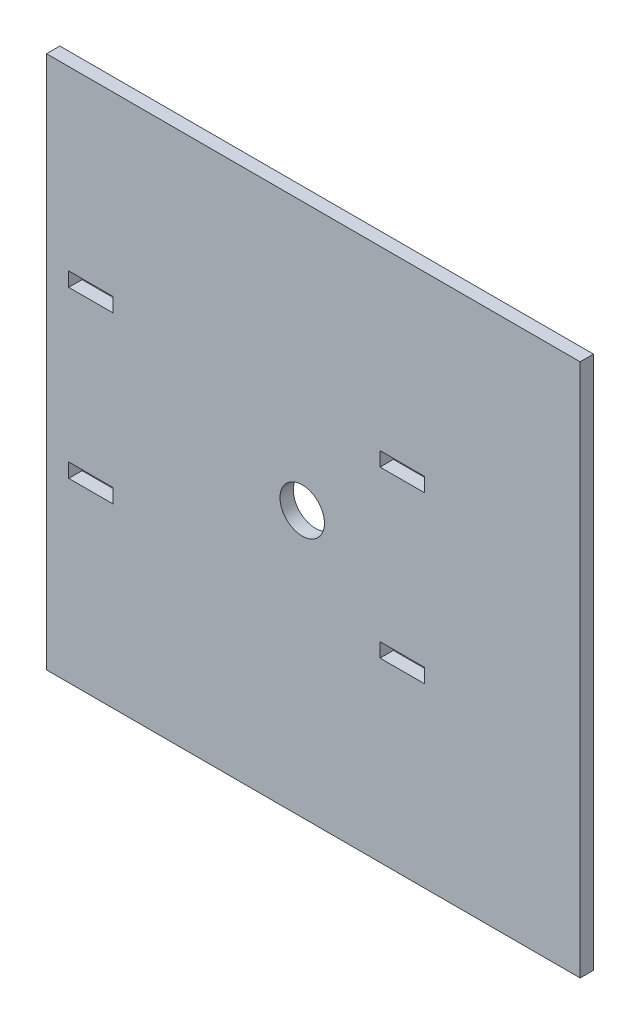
ISO-10303-21;
HEADER;
FILE_DESCRIPTION(('STEP AP214'),'2;1');
FILE_NAME('part.step','',(''),(''),'','','');
FILE_SCHEMA(('AUTOMOTIVE_DESIGN { 1 0 10303 214 1 1 1 1 }'));
ENDSEC;
DATA;
#1=APPLICATION_CONTEXT('core data for automotive mechanical design processes');
#2=APPLICATION_PROTOCOL_DEFINITION('international standard','automotive_design',2000,#1);
#3=PRODUCT_CONTEXT('',#1,'mechanical');
#4=PRODUCT('Part','Part','',(#3));
#5=PRODUCT_RELATED_PRODUCT_CATEGORY('part','',(#4));
#6=PRODUCT_DEFINITION_FORMATION('','',#4);
#7=PRODUCT_DEFINITION_CONTEXT('part definition',#1,'design');
#8=PRODUCT_DEFINITION('design','',#6,#7);
#9=PRODUCT_DEFINITION_SHAPE('','',#8);
#10=(LENGTH_UNIT() NAMED_UNIT(*) SI_UNIT(.MILLI.,.METRE.));
#11=(NAMED_UNIT(*) PLANE_ANGLE_UNIT() SI_UNIT($,.RADIAN.));
#12=(NAMED_UNIT(*) SI_UNIT($,.STERADIAN.) SOLID_ANGLE_UNIT());
#13=UNCERTAINTY_MEASURE_WITH_UNIT(LENGTH_MEASURE(1.E-05),#10,'distance_accuracy_value','');
#14=(GEOMETRIC_REPRESENTATION_CONTEXT(3) GLOBAL_UNCERTAINTY_ASSIGNED_CONTEXT((#13)) GLOBAL_UNIT_ASSIGNED_CONTEXT((#10,
#11,#12)) REPRESENTATION_CONTEXT('',''));
#15=CARTESIAN_POINT('',(0.,0.,0.));
#16=DIRECTION('',(0.,0.,1.));
#17=DIRECTION('',(1.,0.,0.));
#18=AXIS2_PLACEMENT_3D('',#15,#16,#17);
#19=CARTESIAN_POINT('',(0.,0.,3.));
#20=DIRECTION('',(0.,0.,1.));
#21=DIRECTION('',(1.,0.,0.));
#22=AXIS2_PLACEMENT_3D('',#19,#20,#21);
#23=PLANE('',#22);
#24=CARTESIAN_POINT('',(29.0993734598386,-0.2,3.));
#25=DIRECTION('',(0.,0.,1.));
#26=DIRECTION('',(1.,0.,0.));
#27=AXIS2_PLACEMENT_3D('',#24,#25,#26);
#28=CIRCLE('',#27,5.);
#29=CARTESIAN_POINT('',(34.0993734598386,-0.2,3.));
#30=VERTEX_POINT('',#29);
#31=EDGE_CURVE('E198',#30,#30,#28,.T.);
#32=ORIENTED_EDGE('',*,*,#31,.F.);
#33=EDGE_LOOP('',(#32));
#34=FACE_BOUND('',#33,.T.);
#35=DIRECTION('',(0.,-1.,0.));
#36=VECTOR('',#35,1.);
#37=CARTESIAN_POINT('',(-28.4006265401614,60.,3.));
#38=LINE('',#37,#36);
#39=CARTESIAN_POINT('',(-28.4006265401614,60.,3.));
#40=VERTEX_POINT('',#39);
#41=CARTESIAN_POINT('',(-28.4006265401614,-60.,3.));
#42=VERTEX_POINT('',#41);
#43=EDGE_CURVE('E301',#40,#42,#38,.T.);
#44=ORIENTED_EDGE('',*,*,#43,.T.);
#45=DIRECTION('',(1.,0.,0.));
#46=VECTOR('',#45,1.);
#47=CARTESIAN_POINT('',(-28.4006265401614,-60.,3.));
#48=LINE('',#47,#46);
#49=CARTESIAN_POINT('',(91.5993734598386,-60.,3.));
#50=VERTEX_POINT('',#49);
#51=EDGE_CURVE('E304',#42,#50,#48,.T.);
#52=ORIENTED_EDGE('',*,*,#51,.T.);
#53=DIRECTION('',(0.,1.,0.));
#54=VECTOR('',#53,1.);
#55=CARTESIAN_POINT('',(91.5993734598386,60.,3.));
#56=LINE('',#55,#54);
#57=CARTESIAN_POINT('',(91.5993734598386,60.,3.));
#58=VERTEX_POINT('',#57);
#59=EDGE_CURVE('E307',#50,#58,#56,.T.);
#60=ORIENTED_EDGE('',*,*,#59,.T.);
#61=DIRECTION('',(-1.,0.,0.));
#62=VECTOR('',#61,1.);
#63=CARTESIAN_POINT('',(-28.4006265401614,60.,3.));
#64=LINE('',#63,#62);
#65=EDGE_CURVE('E309',#58,#40,#64,.T.);
#66=ORIENTED_EDGE('',*,*,#65,.T.);
#67=EDGE_LOOP('',(#44,#52,#60,#66));
#68=FACE_BOUND('',#67,.T.);
#69=DIRECTION('',(-1.,0.,0.));
#70=VECTOR('',#69,1.);
#71=CARTESIAN_POINT('',(56.5993734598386,20.2,3.));
#72=LINE('',#71,#70);
#73=CARTESIAN_POINT('',(56.5993734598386,20.2,3.));
#74=VERTEX_POINT('',#73);
#75=CARTESIAN_POINT('',(46.5993734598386,20.2,3.));
#76=VERTEX_POINT('',#75);
#77=EDGE_CURVE('E272',#74,#76,#72,.T.);
#78=ORIENTED_EDGE('',*,*,#77,.F.);
#79=DIRECTION('',(0.,1.,0.));
#80=VECTOR('',#79,1.);
#81=CARTESIAN_POINT('',(56.5993734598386,20.2,3.));
#82=LINE('',#81,#80);
#83=CARTESIAN_POINT('',(56.5993734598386,17.,3.));
#84=VERTEX_POINT('',#83);
#85=EDGE_CURVE('E270',#84,#74,#82,.T.);
#86=ORIENTED_EDGE('',*,*,#85,.F.);
#87=DIRECTION('',(1.,0.,0.));
#88=VECTOR('',#87,1.);
#89=CARTESIAN_POINT('',(56.5993734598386,17.,3.));
#90=LINE('',#89,#88);
#91=CARTESIAN_POINT('',(46.5993734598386,17.,3.));
#92=VERTEX_POINT('',#91);
#93=EDGE_CURVE('E278',#92,#84,#90,.T.);
#94=ORIENTED_EDGE('',*,*,#93,.F.);
#95=DIRECTION('',(0.,-1.,0.));
#96=VECTOR('',#95,1.);
#97=CARTESIAN_POINT('',(46.5993734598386,20.2,3.));
#98=LINE('',#97,#96);
#99=EDGE_CURVE('E275',#76,#92,#98,.T.);
#100=ORIENTED_EDGE('',*,*,#99,.F.);
#101=EDGE_LOOP('',(#78,#86,#94,#100));
#102=FACE_BOUND('',#101,.T.);
#103=DIRECTION('',(-1.,0.,0.));
#104=VECTOR('',#103,1.);
#105=CARTESIAN_POINT('',(-13.4006265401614,20.2,3.));
#106=LINE('',#105,#104);
#107=CARTESIAN_POINT('',(-13.4006265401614,20.2,3.));
#108=VERTEX_POINT('',#107);
#109=CARTESIAN_POINT('',(-23.4006265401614,20.2,3.));
#110=VERTEX_POINT('',#109);
#111=EDGE_CURVE('E241',#108,#110,#106,.T.);
#112=ORIENTED_EDGE('',*,*,#111,.F.);
#113=DIRECTION('',(0.,1.,0.));
#114=VECTOR('',#113,1.);
#115=CARTESIAN_POINT('',(-13.4006265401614,20.2,3.));
#116=LINE('',#115,#114);
#117=CARTESIAN_POINT('',(-13.4006265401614,17.,3.));
#118=VERTEX_POINT('',#117);
#119=EDGE_CURVE('E239',#118,#108,#116,.T.);
#120=ORIENTED_EDGE('',*,*,#119,.F.);
#121=DIRECTION('',(1.,0.,0.));
#122=VECTOR('',#121,1.);
#123=CARTESIAN_POINT('',(-13.4006265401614,17.,3.));
#124=LINE('',#123,#122);
#125=CARTESIAN_POINT('',(-23.4006265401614,17.,3.));
#126=VERTEX_POINT('',#125);
#127=EDGE_CURVE('E247',#126,#118,#124,.T.);
#128=ORIENTED_EDGE('',*,*,#127,.F.);
#129=DIRECTION('',(0.,-1.,0.));
#130=VECTOR('',#129,1.);
#131=CARTESIAN_POINT('',(-23.4006265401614,20.2,3.));
#132=LINE('',#131,#130);
#133=EDGE_CURVE('E244',#110,#126,#132,.T.);
#134=ORIENTED_EDGE('',*,*,#133,.F.);
#135=EDGE_LOOP('',(#112,#120,#128,#134));
#136=FACE_BOUND('',#135,.T.);
#137=DIRECTION('',(0.,1.,0.));
#138=VECTOR('',#137,1.);
#139=CARTESIAN_POINT('',(56.5993734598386,-20.2,3.));
#140=LINE('',#139,#138);
#141=CARTESIAN_POINT('',(56.5993734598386,-20.2,3.));
#142=VERTEX_POINT('',#141);
#143=CARTESIAN_POINT('',(56.5993734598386,-17.,3.));
#144=VERTEX_POINT('',#143);
#145=EDGE_CURVE('E210',#142,#144,#140,.T.);
#146=ORIENTED_EDGE('',*,*,#145,.F.);
#147=DIRECTION('',(1.,0.,0.));
#148=VECTOR('',#147,1.);
#149=CARTESIAN_POINT('',(56.5993734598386,-20.2,3.));
#150=LINE('',#149,#148);
#151=CARTESIAN_POINT('',(46.5993734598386,-20.2,3.));
#152=VERTEX_POINT('',#151);
#153=EDGE_CURVE('E208',#152,#142,#150,.T.);
#154=ORIENTED_EDGE('',*,*,#153,.F.);
#155=DIRECTION('',(0.,-1.,0.));
#156=VECTOR('',#155,1.);
#157=CARTESIAN_POINT('',(46.5993734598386,-20.2,3.));
#158=LINE('',#157,#156);
#159=CARTESIAN_POINT('',(46.5993734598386,-17.,3.));
#160=VERTEX_POINT('',#159);
#161=EDGE_CURVE('E216',#160,#152,#158,.T.);
#162=ORIENTED_EDGE('',*,*,#161,.F.);
#163=DIRECTION('',(-1.,0.,0.));
#164=VECTOR('',#163,1.);
#165=CARTESIAN_POINT('',(56.5993734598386,-17.,3.));
#166=LINE('',#165,#164);
#167=EDGE_CURVE('E213',#144,#160,#166,.T.);
#168=ORIENTED_EDGE('',*,*,#167,.F.);
#169=EDGE_LOOP('',(#146,#154,#162,#168));
#170=FACE_BOUND('',#169,.T.);
#171=DIRECTION('',(0.,1.,0.));
#172=VECTOR('',#171,1.);
#173=CARTESIAN_POINT('',(-13.4006265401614,-20.2,3.));
#174=LINE('',#173,#172);
#175=CARTESIAN_POINT('',(-13.4006265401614,-20.2,3.));
#176=VERTEX_POINT('',#175);
#177=CARTESIAN_POINT('',(-13.4006265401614,-17.,3.));
#178=VERTEX_POINT('',#177);
#179=EDGE_CURVE('E178',#176,#178,#174,.T.);
#180=ORIENTED_EDGE('',*,*,#179,.F.);
#181=DIRECTION('',(1.,0.,0.));
#182=VECTOR('',#181,1.);
#183=CARTESIAN_POINT('',(-13.4006265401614,-20.2,3.));
#184=LINE('',#183,#182);
#185=CARTESIAN_POINT('',(-23.4006265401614,-20.2,3.));
#186=VERTEX_POINT('',#185);
#187=EDGE_CURVE('E170',#186,#176,#184,.T.);
#188=ORIENTED_EDGE('',*,*,#187,.F.);
#189=DIRECTION('',(0.,-1.,0.));
#190=VECTOR('',#189,1.);
#191=CARTESIAN_POINT('',(-23.4006265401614,-20.2,3.));
#192=LINE('',#191,#190);
#193=CARTESIAN_POINT('',(-23.4006265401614,-17.,3.));
#194=VERTEX_POINT('',#193);
#195=EDGE_CURVE('E192',#194,#186,#192,.T.);
#196=ORIENTED_EDGE('',*,*,#195,.F.);
#197=DIRECTION('',(-1.,0.,0.));
#198=VECTOR('',#197,1.);
#199=CARTESIAN_POINT('',(-13.4006265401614,-17.,3.));
#200=LINE('',#199,#198);
#201=EDGE_CURVE('E190',#178,#194,#200,.T.);
#202=ORIENTED_EDGE('',*,*,#201,.F.);
#203=EDGE_LOOP('',(#180,#188,#196,#202));
#204=FACE_BOUND('',#203,.T.);
#205=ADVANCED_FACE('F33',(#34,#68,#102,#136,#170,#204),#23,.T.);
#206=CARTESIAN_POINT('',(0.,0.,0.));
#207=DIRECTION('',(0.,0.,1.));
#208=DIRECTION('',(1.,0.,0.));
#209=AXIS2_PLACEMENT_3D('',#206,#207,#208);
#210=PLANE('',#209);
#211=CARTESIAN_POINT('',(29.0993734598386,-0.2,0.));
#212=DIRECTION('',(0.,0.,-1.));
#213=DIRECTION('',(-1.,0.,0.));
#214=AXIS2_PLACEMENT_3D('',#211,#212,#213);
#215=CIRCLE('',#214,5.);
#216=CARTESIAN_POINT('',(24.0993734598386,-0.2,0.));
#217=VERTEX_POINT('',#216);
#218=EDGE_CURVE('E546',#217,#217,#215,.T.);
#219=ORIENTED_EDGE('',*,*,#218,.F.);
#220=EDGE_LOOP('',(#219));
#221=FACE_BOUND('',#220,.T.);
#222=DIRECTION('',(1.,0.,0.));
#223=VECTOR('',#222,1.);
#224=CARTESIAN_POINT('',(56.5993734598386,-20.2,0.));
#225=LINE('',#224,#223);
#226=CARTESIAN_POINT('',(46.5993734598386,-20.2,0.));
#227=VERTEX_POINT('',#226);
#228=CARTESIAN_POINT('',(56.5993734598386,-20.2,0.));
#229=VERTEX_POINT('',#228);
#230=EDGE_CURVE('E186',#227,#229,#225,.T.);
#231=ORIENTED_EDGE('',*,*,#230,.T.);
#232=DIRECTION('',(0.,1.,0.));
#233=VECTOR('',#232,1.);
#234=CARTESIAN_POINT('',(56.5993734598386,-20.2,0.));
#235=LINE('',#234,#233);
#236=CARTESIAN_POINT('',(56.5993734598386,-17.,0.));
#237=VERTEX_POINT('',#236);
#238=EDGE_CURVE('E221',#229,#237,#235,.T.);
#239=ORIENTED_EDGE('',*,*,#238,.T.);
#240=DIRECTION('',(-1.,0.,0.));
#241=VECTOR('',#240,1.);
#242=CARTESIAN_POINT('',(56.5993734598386,-17.,0.));
#243=LINE('',#242,#241);
#244=CARTESIAN_POINT('',(46.5993734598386,-17.,0.));
#245=VERTEX_POINT('',#244);
#246=EDGE_CURVE('E224',#237,#245,#243,.T.);
#247=ORIENTED_EDGE('',*,*,#246,.T.);
#248=DIRECTION('',(0.,-1.,0.));
#249=VECTOR('',#248,1.);
#250=CARTESIAN_POINT('',(46.5993734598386,-20.2,0.));
#251=LINE('',#250,#249);
#252=EDGE_CURVE('E211',#245,#227,#251,.T.);
#253=ORIENTED_EDGE('',*,*,#252,.T.);
#254=EDGE_LOOP('',(#231,#239,#247,#253));
#255=FACE_BOUND('',#254,.T.);
#256=DIRECTION('',(0.,1.,0.));
#257=VECTOR('',#256,1.);
#258=CARTESIAN_POINT('',(56.5993734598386,20.2,0.));
#259=LINE('',#258,#257);
#260=CARTESIAN_POINT('',(56.5993734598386,17.,0.));
#261=VERTEX_POINT('',#260);
#262=CARTESIAN_POINT('',(56.5993734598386,20.2,0.));
#263=VERTEX_POINT('',#262);
#264=EDGE_CURVE('E269',#261,#263,#259,.T.);
#265=ORIENTED_EDGE('',*,*,#264,.T.);
#266=DIRECTION('',(-1.,0.,0.));
#267=VECTOR('',#266,1.);
#268=CARTESIAN_POINT('',(56.5993734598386,20.2,0.));
#269=LINE('',#268,#267);
#270=CARTESIAN_POINT('',(46.5993734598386,20.2,0.));
#271=VERTEX_POINT('',#270);
#272=EDGE_CURVE('E283',#263,#271,#269,.T.);
#273=ORIENTED_EDGE('',*,*,#272,.T.);
#274=DIRECTION('',(0.,-1.,0.));
#275=VECTOR('',#274,1.);
#276=CARTESIAN_POINT('',(46.5993734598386,20.2,0.));
#277=LINE('',#276,#275);
#278=CARTESIAN_POINT('',(46.5993734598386,17.,0.));
#279=VERTEX_POINT('',#278);
#280=EDGE_CURVE('E286',#271,#279,#277,.T.);
#281=ORIENTED_EDGE('',*,*,#280,.T.);
#282=DIRECTION('',(1.,0.,0.));
#283=VECTOR('',#282,1.);
#284=CARTESIAN_POINT('',(56.5993734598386,17.,0.));
#285=LINE('',#284,#283);
#286=EDGE_CURVE('E273',#279,#261,#285,.T.);
#287=ORIENTED_EDGE('',*,*,#286,.T.);
#288=EDGE_LOOP('',(#265,#273,#281,#287));
#289=FACE_BOUND('',#288,.T.);
#290=DIRECTION('',(0.,-1.,0.));
#291=VECTOR('',#290,1.);
#292=CARTESIAN_POINT('',(-28.4006265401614,60.,0.));
#293=LINE('',#292,#291);
#294=CARTESIAN_POINT('',(-28.4006265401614,60.,0.));
#295=VERTEX_POINT('',#294);
#296=CARTESIAN_POINT('',(-28.4006265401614,-60.,0.));
#297=VERTEX_POINT('',#296);
#298=EDGE_CURVE('E300',#295,#297,#293,.T.);
#299=ORIENTED_EDGE('',*,*,#298,.F.);
#300=DIRECTION('',(-1.,0.,0.));
#301=VECTOR('',#300,1.);
#302=CARTESIAN_POINT('',(-28.4006265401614,60.,0.));
#303=LINE('',#302,#301);
#304=CARTESIAN_POINT('',(91.5993734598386,60.,0.));
#305=VERTEX_POINT('',#304);
#306=EDGE_CURVE('E305',#305,#295,#303,.T.);
#307=ORIENTED_EDGE('',*,*,#306,.F.);
#308=DIRECTION('',(0.,1.,0.));
#309=VECTOR('',#308,1.);
#310=CARTESIAN_POINT('',(91.5993734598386,60.,0.));
#311=LINE('',#310,#309);
#312=CARTESIAN_POINT('',(91.5993734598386,-60.,0.));
#313=VERTEX_POINT('',#312);
#314=EDGE_CURVE('E316',#313,#305,#311,.T.);
#315=ORIENTED_EDGE('',*,*,#314,.F.);
#316=DIRECTION('',(1.,0.,0.));
#317=VECTOR('',#316,1.);
#318=CARTESIAN_POINT('',(-28.4006265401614,-60.,0.));
#319=LINE('',#318,#317);
#320=EDGE_CURVE('E314',#297,#313,#319,.T.);
#321=ORIENTED_EDGE('',*,*,#320,.F.);
#322=EDGE_LOOP('',(#299,#307,#315,#321));
#323=FACE_BOUND('',#322,.T.);
#324=DIRECTION('',(0.,1.,0.));
#325=VECTOR('',#324,1.);
#326=CARTESIAN_POINT('',(-13.4006265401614,20.2,0.));
#327=LINE('',#326,#325);
#328=CARTESIAN_POINT('',(-13.4006265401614,17.,0.));
#329=VERTEX_POINT('',#328);
#330=CARTESIAN_POINT('',(-13.4006265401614,20.2,0.));
#331=VERTEX_POINT('',#330);
#332=EDGE_CURVE('E238',#329,#331,#327,.T.);
#333=ORIENTED_EDGE('',*,*,#332,.T.);
#334=DIRECTION('',(-1.,0.,0.));
#335=VECTOR('',#334,1.);
#336=CARTESIAN_POINT('',(-13.4006265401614,20.2,0.));
#337=LINE('',#336,#335);
#338=CARTESIAN_POINT('',(-23.4006265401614,20.2,0.));
#339=VERTEX_POINT('',#338);
#340=EDGE_CURVE('E252',#331,#339,#337,.T.);
#341=ORIENTED_EDGE('',*,*,#340,.T.);
#342=DIRECTION('',(0.,-1.,0.));
#343=VECTOR('',#342,1.);
#344=CARTESIAN_POINT('',(-23.4006265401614,20.2,0.));
#345=LINE('',#344,#343);
#346=CARTESIAN_POINT('',(-23.4006265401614,17.,0.));
#347=VERTEX_POINT('',#346);
#348=EDGE_CURVE('E255',#339,#347,#345,.T.);
#349=ORIENTED_EDGE('',*,*,#348,.T.);
#350=DIRECTION('',(1.,0.,0.));
#351=VECTOR('',#350,1.);
#352=CARTESIAN_POINT('',(-13.4006265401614,17.,0.));
#353=LINE('',#352,#351);
#354=EDGE_CURVE('E242',#347,#329,#353,.T.);
#355=ORIENTED_EDGE('',*,*,#354,.T.);
#356=EDGE_LOOP('',(#333,#341,#349,#355));
#357=FACE_BOUND('',#356,.T.);
#358=DIRECTION('',(1.,0.,0.));
#359=VECTOR('',#358,1.);
#360=CARTESIAN_POINT('',(-13.4006265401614,-20.2,0.));
#361=LINE('',#360,#359);
#362=CARTESIAN_POINT('',(-23.4006265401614,-20.2,0.));
#363=VERTEX_POINT('',#362);
#364=CARTESIAN_POINT('',(-13.4006265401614,-20.2,0.));
#365=VERTEX_POINT('',#364);
#366=EDGE_CURVE('E56',#363,#365,#361,.T.);
#367=ORIENTED_EDGE('',*,*,#366,.T.);
#368=DIRECTION('',(0.,1.,0.));
#369=VECTOR('',#368,1.);
#370=CARTESIAN_POINT('',(-13.4006265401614,-20.2,0.));
#371=LINE('',#370,#369);
#372=CARTESIAN_POINT('',(-13.4006265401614,-17.,0.));
#373=VERTEX_POINT('',#372);
#374=EDGE_CURVE('E185',#365,#373,#371,.T.);
#375=ORIENTED_EDGE('',*,*,#374,.T.);
#376=DIRECTION('',(-1.,0.,0.));
#377=VECTOR('',#376,1.);
#378=CARTESIAN_POINT('',(-13.4006265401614,-17.,0.));
#379=LINE('',#378,#377);
#380=CARTESIAN_POINT('',(-23.4006265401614,-17.,0.));
#381=VERTEX_POINT('',#380);
#382=EDGE_CURVE('E200',#373,#381,#379,.T.);
#383=ORIENTED_EDGE('',*,*,#382,.T.);
#384=DIRECTION('',(0.,-1.,0.));
#385=VECTOR('',#384,1.);
#386=CARTESIAN_POINT('',(-23.4006265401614,-20.2,0.));
#387=LINE('',#386,#385);
#388=EDGE_CURVE('E179',#381,#363,#387,.T.);
#389=ORIENTED_EDGE('',*,*,#388,.T.);
#390=EDGE_LOOP('',(#367,#375,#383,#389));
#391=FACE_BOUND('',#390,.T.);
#392=ADVANCED_FACE('F334',(#221,#255,#289,#323,#357,#391),#210,.F.);
#393=CARTESIAN_POINT('',(-28.4006265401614,60.,3.));
#394=DIRECTION('',(1.,0.,0.));
#395=DIRECTION('',(0.,1.,0.));
#396=AXIS2_PLACEMENT_3D('',#393,#394,#395);
#397=PLANE('',#396);
#398=ORIENTED_EDGE('',*,*,#298,.T.);
#399=DIRECTION('',(0.,0.,-1.));
#400=VECTOR('',#399,1.);
#401=CARTESIAN_POINT('',(-28.4006265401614,-60.,3.));
#402=LINE('',#401,#400);
#403=EDGE_CURVE('E11',#42,#297,#402,.T.);
#404=ORIENTED_EDGE('',*,*,#403,.F.);
#405=ORIENTED_EDGE('',*,*,#43,.F.);
#406=DIRECTION('',(0.,0.,-1.));
#407=VECTOR('',#406,1.);
#408=CARTESIAN_POINT('',(-28.4006265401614,60.,3.));
#409=LINE('',#408,#407);
#410=EDGE_CURVE('E311',#40,#295,#409,.T.);
#411=ORIENTED_EDGE('',*,*,#410,.T.);
#412=EDGE_LOOP('',(#398,#404,#405,#411));
#413=FACE_BOUND('',#412,.T.);
#414=ADVANCED_FACE('F35',(#413),#397,.F.);
#415=CARTESIAN_POINT('',(-28.4006265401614,-60.,3.));
#416=DIRECTION('',(0.,1.,0.));
#417=DIRECTION('',(0.,0.,1.));
#418=AXIS2_PLACEMENT_3D('',#415,#416,#417);
#419=PLANE('',#418);
#420=ORIENTED_EDGE('',*,*,#320,.T.);
#421=DIRECTION('',(0.,0.,-1.));
#422=VECTOR('',#421,1.);
#423=CARTESIAN_POINT('',(91.5993734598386,-60.,3.));
#424=LINE('',#423,#422);
#425=EDGE_CURVE('E41',#50,#313,#424,.T.);
#426=ORIENTED_EDGE('',*,*,#425,.F.);
#427=ORIENTED_EDGE('',*,*,#51,.F.);
#428=ORIENTED_EDGE('',*,*,#403,.T.);
#429=EDGE_LOOP('',(#420,#426,#427,#428));
#430=FACE_BOUND('',#429,.T.);
#431=ADVANCED_FACE('F345',(#430),#419,.F.);
#432=CARTESIAN_POINT('',(91.5993734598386,60.,3.));
#433=DIRECTION('',(-1.,0.,0.));
#434=DIRECTION('',(0.,-1.,0.));
#435=AXIS2_PLACEMENT_3D('',#432,#433,#434);
#436=PLANE('',#435);
#437=ORIENTED_EDGE('',*,*,#314,.T.);
#438=DIRECTION('',(0.,0.,-1.));
#439=VECTOR('',#438,1.);
#440=CARTESIAN_POINT('',(91.5993734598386,60.,3.));
#441=LINE('',#440,#439);
#442=EDGE_CURVE('E321',#58,#305,#441,.T.);
#443=ORIENTED_EDGE('',*,*,#442,.F.);
#444=ORIENTED_EDGE('',*,*,#59,.F.);
#445=ORIENTED_EDGE('',*,*,#425,.T.);
#446=EDGE_LOOP('',(#437,#443,#444,#445));
#447=FACE_BOUND('',#446,.T.);
#448=ADVANCED_FACE('F328',(#447),#436,.F.);
#449=CARTESIAN_POINT('',(-28.4006265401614,60.,3.));
#450=DIRECTION('',(0.,-1.,0.));
#451=DIRECTION('',(0.,0.,-1.));
#452=AXIS2_PLACEMENT_3D('',#449,#450,#451);
#453=PLANE('',#452);
#454=ORIENTED_EDGE('',*,*,#306,.T.);
#455=ORIENTED_EDGE('',*,*,#410,.F.);
#456=ORIENTED_EDGE('',*,*,#65,.F.);
#457=ORIENTED_EDGE('',*,*,#442,.T.);
#458=EDGE_LOOP('',(#454,#455,#456,#457));
#459=FACE_BOUND('',#458,.T.);
#460=ADVANCED_FACE('F338',(#459),#453,.F.);
#461=CARTESIAN_POINT('',(56.5993734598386,20.2,3.));
#462=DIRECTION('',(-1.,0.,0.));
#463=DIRECTION('',(0.,-1.,0.));
#464=AXIS2_PLACEMENT_3D('',#461,#462,#463);
#465=PLANE('',#464);
#466=ORIENTED_EDGE('',*,*,#264,.F.);
#467=DIRECTION('',(0.,0.,-1.));
#468=VECTOR('',#467,1.);
#469=CARTESIAN_POINT('',(56.5993734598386,17.,3.));
#470=LINE('',#469,#468);
#471=EDGE_CURVE('E280',#84,#261,#470,.T.);
#472=ORIENTED_EDGE('',*,*,#471,.F.);
#473=ORIENTED_EDGE('',*,*,#85,.T.);
#474=DIRECTION('',(0.,0.,-1.));
#475=VECTOR('',#474,1.);
#476=CARTESIAN_POINT('',(56.5993734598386,20.2,3.));
#477=LINE('',#476,#475);
#478=EDGE_CURVE('E297',#74,#263,#477,.T.);
#479=ORIENTED_EDGE('',*,*,#478,.T.);
#480=EDGE_LOOP('',(#466,#472,#473,#479));
#481=FACE_BOUND('',#480,.T.);
#482=ADVANCED_FACE('F362',(#481),#465,.T.);
#483=CARTESIAN_POINT('',(56.5993734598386,20.2,3.));
#484=DIRECTION('',(0.,-1.,0.));
#485=DIRECTION('',(0.,0.,-1.));
#486=AXIS2_PLACEMENT_3D('',#483,#484,#485);
#487=PLANE('',#486);
#488=ORIENTED_EDGE('',*,*,#272,.F.);
#489=ORIENTED_EDGE('',*,*,#478,.F.);
#490=ORIENTED_EDGE('',*,*,#77,.T.);
#491=DIRECTION('',(0.,0.,-1.));
#492=VECTOR('',#491,1.);
#493=CARTESIAN_POINT('',(46.5993734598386,20.2,3.));
#494=LINE('',#493,#492);
#495=EDGE_CURVE('E295',#76,#271,#494,.T.);
#496=ORIENTED_EDGE('',*,*,#495,.T.);
#497=EDGE_LOOP('',(#488,#489,#490,#496));
#498=FACE_BOUND('',#497,.T.);
#499=ADVANCED_FACE('F369',(#498),#487,.T.);
#500=CARTESIAN_POINT('',(46.5993734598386,20.2,3.));
#501=DIRECTION('',(1.,0.,0.));
#502=DIRECTION('',(0.,0.,-1.));
#503=AXIS2_PLACEMENT_3D('',#500,#501,#502);
#504=PLANE('',#503);
#505=ORIENTED_EDGE('',*,*,#280,.F.);
#506=ORIENTED_EDGE('',*,*,#495,.F.);
#507=ORIENTED_EDGE('',*,*,#99,.T.);
#508=DIRECTION('',(0.,0.,-1.));
#509=VECTOR('',#508,1.);
#510=CARTESIAN_POINT('',(46.5993734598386,17.,3.));
#511=LINE('',#510,#509);
#512=EDGE_CURVE('E293',#92,#279,#511,.T.);
#513=ORIENTED_EDGE('',*,*,#512,.T.);
#514=EDGE_LOOP('',(#505,#506,#507,#513));
#515=FACE_BOUND('',#514,.T.);
#516=ADVANCED_FACE('F374',(#515),#504,.T.);
#517=CARTESIAN_POINT('',(56.5993734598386,17.,3.));
#518=DIRECTION('',(0.,1.,0.));
#519=DIRECTION('',(0.,0.,1.));
#520=AXIS2_PLACEMENT_3D('',#517,#518,#519);
#521=PLANE('',#520);
#522=ORIENTED_EDGE('',*,*,#286,.F.);
#523=ORIENTED_EDGE('',*,*,#512,.F.);
#524=ORIENTED_EDGE('',*,*,#93,.T.);
#525=ORIENTED_EDGE('',*,*,#471,.T.);
#526=EDGE_LOOP('',(#522,#523,#524,#525));
#527=FACE_BOUND('',#526,.T.);
#528=ADVANCED_FACE('F382',(#527),#521,.T.);
#529=CARTESIAN_POINT('',(-13.4006265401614,20.2,3.));
#530=DIRECTION('',(-1.,0.,0.));
#531=DIRECTION('',(0.,0.,1.));
#532=AXIS2_PLACEMENT_3D('',#529,#530,#531);
#533=PLANE('',#532);
#534=ORIENTED_EDGE('',*,*,#332,.F.);
#535=DIRECTION('',(0.,0.,-1.));
#536=VECTOR('',#535,1.);
#537=CARTESIAN_POINT('',(-13.4006265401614,17.,3.));
#538=LINE('',#537,#536);
#539=EDGE_CURVE('E249',#118,#329,#538,.T.);
#540=ORIENTED_EDGE('',*,*,#539,.F.);
#541=ORIENTED_EDGE('',*,*,#119,.T.);
#542=DIRECTION('',(0.,0.,-1.));
#543=VECTOR('',#542,1.);
#544=CARTESIAN_POINT('',(-13.4006265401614,20.2,3.));
#545=LINE('',#544,#543);
#546=EDGE_CURVE('E266',#108,#331,#545,.T.);
#547=ORIENTED_EDGE('',*,*,#546,.T.);
#548=EDGE_LOOP('',(#534,#540,#541,#547));
#549=FACE_BOUND('',#548,.T.);
#550=ADVANCED_FACE('F437',(#549),#533,.T.);
#551=CARTESIAN_POINT('',(-13.4006265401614,20.2,3.));
#552=DIRECTION('',(0.,-1.,0.));
#553=DIRECTION('',(0.,0.,-1.));
#554=AXIS2_PLACEMENT_3D('',#551,#552,#553);
#555=PLANE('',#554);
#556=ORIENTED_EDGE('',*,*,#340,.F.);
#557=ORIENTED_EDGE('',*,*,#546,.F.);
#558=ORIENTED_EDGE('',*,*,#111,.T.);
#559=DIRECTION('',(0.,0.,-1.));
#560=VECTOR('',#559,1.);
#561=CARTESIAN_POINT('',(-23.4006265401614,20.2,3.));
#562=LINE('',#561,#560);
#563=EDGE_CURVE('E264',#110,#339,#562,.T.);
#564=ORIENTED_EDGE('',*,*,#563,.T.);
#565=EDGE_LOOP('',(#556,#557,#558,#564));
#566=FACE_BOUND('',#565,.T.);
#567=ADVANCED_FACE('F433',(#566),#555,.T.);
#568=CARTESIAN_POINT('',(-23.4006265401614,20.2,3.));
#569=DIRECTION('',(1.,0.,0.));
#570=DIRECTION('',(0.,0.,-1.));
#571=AXIS2_PLACEMENT_3D('',#568,#569,#570);
#572=PLANE('',#571);
#573=ORIENTED_EDGE('',*,*,#348,.F.);
#574=ORIENTED_EDGE('',*,*,#563,.F.);
#575=ORIENTED_EDGE('',*,*,#133,.T.);
#576=DIRECTION('',(0.,0.,-1.));
#577=VECTOR('',#576,1.);
#578=CARTESIAN_POINT('',(-23.4006265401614,17.,3.));
#579=LINE('',#578,#577);
#580=EDGE_CURVE('E262',#126,#347,#579,.T.);
#581=ORIENTED_EDGE('',*,*,#580,.T.);
#582=EDGE_LOOP('',(#573,#574,#575,#581));
#583=FACE_BOUND('',#582,.T.);
#584=ADVANCED_FACE('F429',(#583),#572,.T.);
#585=CARTESIAN_POINT('',(-13.4006265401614,17.,3.));
#586=DIRECTION('',(0.,1.,0.));
#587=DIRECTION('',(-1.,0.,0.));
#588=AXIS2_PLACEMENT_3D('',#585,#586,#587);
#589=PLANE('',#588);
#590=ORIENTED_EDGE('',*,*,#354,.F.);
#591=ORIENTED_EDGE('',*,*,#580,.F.);
#592=ORIENTED_EDGE('',*,*,#127,.T.);
#593=ORIENTED_EDGE('',*,*,#539,.T.);
#594=EDGE_LOOP('',(#590,#591,#592,#593));
#595=FACE_BOUND('',#594,.T.);
#596=ADVANCED_FACE('F426',(#595),#589,.T.);
#597=CARTESIAN_POINT('',(56.5993734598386,-20.2,3.));
#598=DIRECTION('',(0.,1.,0.));
#599=DIRECTION('',(0.,0.,1.));
#600=AXIS2_PLACEMENT_3D('',#597,#598,#599);
#601=PLANE('',#600);
#602=ORIENTED_EDGE('',*,*,#230,.F.);
#603=DIRECTION('',(0.,0.,-1.));
#604=VECTOR('',#603,1.);
#605=CARTESIAN_POINT('',(46.5993734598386,-20.2,3.));
#606=LINE('',#605,#604);
#607=EDGE_CURVE('E218',#152,#227,#606,.T.);
#608=ORIENTED_EDGE('',*,*,#607,.F.);
#609=ORIENTED_EDGE('',*,*,#153,.T.);
#610=DIRECTION('',(0.,0.,-1.));
#611=VECTOR('',#610,1.);
#612=CARTESIAN_POINT('',(56.5993734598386,-20.2,3.));
#613=LINE('',#612,#611);
#614=EDGE_CURVE('E235',#142,#229,#613,.T.);
#615=ORIENTED_EDGE('',*,*,#614,.T.);
#616=EDGE_LOOP('',(#602,#608,#609,#615));
#617=FACE_BOUND('',#616,.T.);
#618=ADVANCED_FACE('F408',(#617),#601,.T.);
#619=CARTESIAN_POINT('',(56.5993734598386,-20.2,3.));
#620=DIRECTION('',(-1.,0.,0.));
#621=DIRECTION('',(0.,-1.,0.));
#622=AXIS2_PLACEMENT_3D('',#619,#620,#621);
#623=PLANE('',#622);
#624=ORIENTED_EDGE('',*,*,#238,.F.);
#625=ORIENTED_EDGE('',*,*,#614,.F.);
#626=ORIENTED_EDGE('',*,*,#145,.T.);
#627=DIRECTION('',(0.,0.,-1.));
#628=VECTOR('',#627,1.);
#629=CARTESIAN_POINT('',(56.5993734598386,-17.,3.));
#630=LINE('',#629,#628);
#631=EDGE_CURVE('E233',#144,#237,#630,.T.);
#632=ORIENTED_EDGE('',*,*,#631,.T.);
#633=EDGE_LOOP('',(#624,#625,#626,#632));
#634=FACE_BOUND('',#633,.T.);
#635=ADVANCED_FACE('F401',(#634),#623,.T.);
#636=CARTESIAN_POINT('',(56.5993734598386,-17.,3.));
#637=DIRECTION('',(0.,-1.,0.));
#638=DIRECTION('',(0.,0.,-1.));
#639=AXIS2_PLACEMENT_3D('',#636,#637,#638);
#640=PLANE('',#639);
#641=ORIENTED_EDGE('',*,*,#246,.F.);
#642=ORIENTED_EDGE('',*,*,#631,.F.);
#643=ORIENTED_EDGE('',*,*,#167,.T.);
#644=DIRECTION('',(0.,0.,-1.));
#645=VECTOR('',#644,1.);
#646=CARTESIAN_POINT('',(46.5993734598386,-17.,3.));
#647=LINE('',#646,#645);
#648=EDGE_CURVE('E231',#160,#245,#647,.T.);
#649=ORIENTED_EDGE('',*,*,#648,.T.);
#650=EDGE_LOOP('',(#641,#642,#643,#649));
#651=FACE_BOUND('',#650,.T.);
#652=ADVANCED_FACE('F404',(#651),#640,.T.);
#653=CARTESIAN_POINT('',(46.5993734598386,-20.2,3.));
#654=DIRECTION('',(1.,0.,0.));
#655=DIRECTION('',(0.,0.,-1.));
#656=AXIS2_PLACEMENT_3D('',#653,#654,#655);
#657=PLANE('',#656);
#658=ORIENTED_EDGE('',*,*,#252,.F.);
#659=ORIENTED_EDGE('',*,*,#648,.F.);
#660=ORIENTED_EDGE('',*,*,#161,.T.);
#661=ORIENTED_EDGE('',*,*,#607,.T.);
#662=EDGE_LOOP('',(#658,#659,#660,#661));
#663=FACE_BOUND('',#662,.T.);
#664=ADVANCED_FACE('F411',(#663),#657,.T.);
#665=CARTESIAN_POINT('',(-13.4006265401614,-20.2,3.));
#666=DIRECTION('',(0.,1.,0.));
#667=DIRECTION('',(0.,0.,1.));
#668=AXIS2_PLACEMENT_3D('',#665,#666,#667);
#669=PLANE('',#668);
#670=ORIENTED_EDGE('',*,*,#366,.F.);
#671=DIRECTION('',(0.,0.,-1.));
#672=VECTOR('',#671,1.);
#673=CARTESIAN_POINT('',(-23.4006265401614,-20.2,3.));
#674=LINE('',#673,#672);
#675=EDGE_CURVE('E174',#186,#363,#674,.T.);
#676=ORIENTED_EDGE('',*,*,#675,.F.);
#677=ORIENTED_EDGE('',*,*,#187,.T.);
#678=DIRECTION('',(0.,0.,-1.));
#679=VECTOR('',#678,1.);
#680=CARTESIAN_POINT('',(-13.4006265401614,-20.2,3.));
#681=LINE('',#680,#679);
#682=EDGE_CURVE('E173',#176,#365,#681,.T.);
#683=ORIENTED_EDGE('',*,*,#682,.T.);
#684=EDGE_LOOP('',(#670,#676,#677,#683));
#685=FACE_BOUND('',#684,.T.);
#686=ADVANCED_FACE('F172',(#685),#669,.T.);
#687=CARTESIAN_POINT('',(-13.4006265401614,-20.2,3.));
#688=DIRECTION('',(-1.,0.,0.));
#689=DIRECTION('',(0.,0.,1.));
#690=AXIS2_PLACEMENT_3D('',#687,#688,#689);
#691=PLANE('',#690);
#692=ORIENTED_EDGE('',*,*,#374,.F.);
#693=ORIENTED_EDGE('',*,*,#682,.F.);
#694=ORIENTED_EDGE('',*,*,#179,.T.);
#695=DIRECTION('',(0.,0.,-1.));
#696=VECTOR('',#695,1.);
#697=CARTESIAN_POINT('',(-13.4006265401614,-17.,3.));
#698=LINE('',#697,#696);
#699=EDGE_CURVE('E187',#178,#373,#698,.T.);
#700=ORIENTED_EDGE('',*,*,#699,.T.);
#701=EDGE_LOOP('',(#692,#693,#694,#700));
#702=FACE_BOUND('',#701,.T.);
#703=ADVANCED_FACE('F182',(#702),#691,.T.);
#704=CARTESIAN_POINT('',(-13.4006265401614,-17.,3.));
#705=DIRECTION('',(0.,-1.,0.));
#706=DIRECTION('',(1.,0.,0.));
#707=AXIS2_PLACEMENT_3D('',#704,#705,#706);
#708=PLANE('',#707);
#709=ORIENTED_EDGE('',*,*,#382,.F.);
#710=ORIENTED_EDGE('',*,*,#699,.F.);
#711=ORIENTED_EDGE('',*,*,#201,.T.);
#712=DIRECTION('',(0.,0.,-1.));
#713=VECTOR('',#712,1.);
#714=CARTESIAN_POINT('',(-23.4006265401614,-17.,3.));
#715=LINE('',#714,#713);
#716=EDGE_CURVE('E48',#194,#381,#715,.T.);
#717=ORIENTED_EDGE('',*,*,#716,.T.);
#718=EDGE_LOOP('',(#709,#710,#711,#717));
#719=FACE_BOUND('',#718,.T.);
#720=ADVANCED_FACE('F500',(#719),#708,.T.);
#721=CARTESIAN_POINT('',(-23.4006265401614,-20.2,3.));
#722=DIRECTION('',(1.,0.,0.));
#723=DIRECTION('',(0.,0.,-1.));
#724=AXIS2_PLACEMENT_3D('',#721,#722,#723);
#725=PLANE('',#724);
#726=ORIENTED_EDGE('',*,*,#388,.F.);
#727=ORIENTED_EDGE('',*,*,#716,.F.);
#728=ORIENTED_EDGE('',*,*,#195,.T.);
#729=ORIENTED_EDGE('',*,*,#675,.T.);
#730=EDGE_LOOP('',(#726,#727,#728,#729));
#731=FACE_BOUND('',#730,.T.);
#732=ADVANCED_FACE('F508',(#731),#725,.T.);
#733=CARTESIAN_POINT('',(29.0993734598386,-0.2,10.));
#734=DIRECTION('',(0.,0.,-1.));
#735=DIRECTION('',(-1.,0.,0.));
#736=AXIS2_PLACEMENT_3D('',#733,#734,#735);
#737=CYLINDRICAL_SURFACE('',#736,5.);
#738=ORIENTED_EDGE('',*,*,#31,.T.);
#739=EDGE_LOOP('',(#738));
#740=FACE_BOUND('',#739,.T.);
#741=ORIENTED_EDGE('',*,*,#218,.T.);
#742=EDGE_LOOP('',(#741));
#743=FACE_BOUND('',#742,.T.);
#744=ADVANCED_FACE('F517',(#740,#743),#737,.F.);
#745=CLOSED_SHELL('',(#205,#392,#414,#431,#448,#460,#482,#499,#516,#528,#550,#567,#584,#596,
#618,#635,#652,#664,#686,#703,#720,#732,#744));
#746=MANIFOLD_SOLID_BREP('B2',#745);
#747=ADVANCED_BREP_SHAPE_REPRESENTATION('',(#18,#746),#14);
#748=SHAPE_DEFINITION_REPRESENTATION(#9,#747);
ENDSEC;
END-ISO-10303-21;
